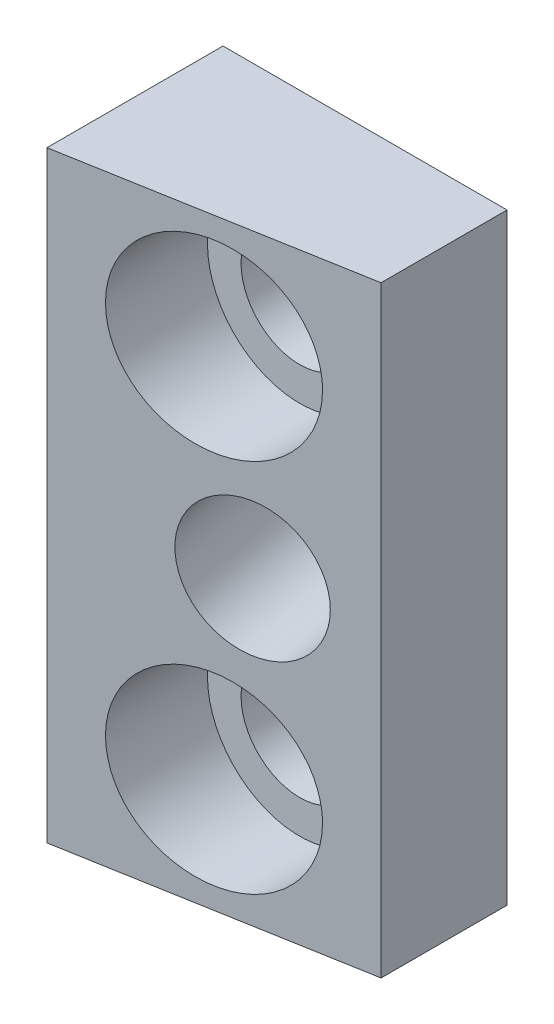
ISO-10303-21;
HEADER;
FILE_DESCRIPTION(('STEP AP214'),'2;1');
FILE_NAME('part.step','',(''),(''),'','','');
FILE_SCHEMA(('AUTOMOTIVE_DESIGN { 1 0 10303 214 1 1 1 1 }'));
ENDSEC;
DATA;
#1=APPLICATION_CONTEXT('core data for automotive mechanical design processes');
#2=APPLICATION_PROTOCOL_DEFINITION('international standard','automotive_design',2000,#1);
#3=PRODUCT_CONTEXT('',#1,'mechanical');
#4=PRODUCT('Part','Part','',(#3));
#5=PRODUCT_RELATED_PRODUCT_CATEGORY('part','',(#4));
#6=PRODUCT_DEFINITION_FORMATION('','',#4);
#7=PRODUCT_DEFINITION_CONTEXT('part definition',#1,'design');
#8=PRODUCT_DEFINITION('design','',#6,#7);
#9=PRODUCT_DEFINITION_SHAPE('','',#8);
#10=(LENGTH_UNIT() NAMED_UNIT(*) SI_UNIT(.MILLI.,.METRE.));
#11=(NAMED_UNIT(*) PLANE_ANGLE_UNIT() SI_UNIT($,.RADIAN.));
#12=(NAMED_UNIT(*) SI_UNIT($,.STERADIAN.) SOLID_ANGLE_UNIT());
#13=UNCERTAINTY_MEASURE_WITH_UNIT(LENGTH_MEASURE(1.E-05),#10,'distance_accuracy_value','');
#14=(GEOMETRIC_REPRESENTATION_CONTEXT(3) GLOBAL_UNCERTAINTY_ASSIGNED_CONTEXT((#13)) GLOBAL_UNIT_ASSIGNED_CONTEXT((#10,
#11,#12)) REPRESENTATION_CONTEXT('',''));
#15=CARTESIAN_POINT('',(0.,0.,0.));
#16=DIRECTION('',(0.,0.,1.));
#17=DIRECTION('',(1.,0.,0.));
#18=AXIS2_PLACEMENT_3D('',#15,#16,#17);
#19=CARTESIAN_POINT('',(-12.7,43.688,15.748));
#20=DIRECTION('',(-0.173648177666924,0.,-0.984807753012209));
#21=DIRECTION('',(-0.984807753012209,0.,0.173648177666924));
#22=AXIS2_PLACEMENT_3D('',#19,#20,#21);
#23=PLANE('',#22);
#24=CARTESIAN_POINT('',(2.93382307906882,16.764,12.9913351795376));
#25=DIRECTION('',(0.173648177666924,0.,0.984807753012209));
#26=DIRECTION('',(0.984807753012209,0.,-0.173648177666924));
#27=AXIS2_PLACEMENT_3D('',#24,#25,#26);
#28=CIRCLE('',#27,6.);
#29=CARTESIAN_POINT('',(8.84266959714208,16.764,11.9494461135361));
#30=VERTEX_POINT('',#29);
#31=EDGE_CURVE('E118',#30,#30,#28,.T.);
#32=ORIENTED_EDGE('',*,*,#31,.F.);
#33=EDGE_LOOP('',(#32));
#34=FACE_BOUND('',#33,.T.);
#35=CARTESIAN_POINT('',(0.,33.528,13.5086473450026));
#36=DIRECTION('',(-0.173648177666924,0.,-0.984807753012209));
#37=DIRECTION('',(0.984807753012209,0.,-0.173648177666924));
#38=AXIS2_PLACEMENT_3D('',#35,#36,#37);
#39=ELLIPSE('',#38,8.37726954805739,8.25);
#40=CARTESIAN_POINT('',(8.25,33.528,12.0539497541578));
#41=VERTEX_POINT('',#40);
#42=EDGE_CURVE('E103',#41,#41,#39,.F.);
#43=ORIENTED_EDGE('',*,*,#42,.F.);
#44=EDGE_LOOP('',(#43));
#45=FACE_BOUND('',#44,.T.);
#46=DIRECTION('',(0.984807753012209,0.,-0.173648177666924));
#47=VECTOR('',#46,1.);
#48=CARTESIAN_POINT('',(-12.7,-10.16,15.748));
#49=LINE('',#48,#47);
#50=CARTESIAN_POINT('',(-12.7,-10.16,15.748));
#51=VERTEX_POINT('',#50);
#52=CARTESIAN_POINT('',(12.7,-10.16,11.2692946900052));
#53=VERTEX_POINT('',#52);
#54=EDGE_CURVE('E87',#51,#53,#49,.T.);
#55=ORIENTED_EDGE('',*,*,#54,.T.);
#56=DIRECTION('',(0.,-1.,0.));
#57=VECTOR('',#56,1.);
#58=CARTESIAN_POINT('',(12.7,43.688,11.2692946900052));
#59=LINE('',#58,#57);
#60=CARTESIAN_POINT('',(12.7,43.688,11.2692946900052));
#61=VERTEX_POINT('',#60);
#62=EDGE_CURVE('E76',#61,#53,#59,.T.);
#63=ORIENTED_EDGE('',*,*,#62,.F.);
#64=DIRECTION('',(0.984807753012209,0.,-0.173648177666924));
#65=VECTOR('',#64,1.);
#66=CARTESIAN_POINT('',(-12.7,43.688,15.748));
#67=LINE('',#66,#65);
#68=CARTESIAN_POINT('',(-12.7,43.688,15.748));
#69=VERTEX_POINT('',#68);
#70=EDGE_CURVE('E34',#69,#61,#67,.T.);
#71=ORIENTED_EDGE('',*,*,#70,.F.);
#72=DIRECTION('',(0.,-1.,0.));
#73=VECTOR('',#72,1.);
#74=CARTESIAN_POINT('',(-12.7,43.688,15.748));
#75=LINE('',#74,#73);
#76=EDGE_CURVE('E95',#69,#51,#75,.T.);
#77=ORIENTED_EDGE('',*,*,#76,.T.);
#78=EDGE_LOOP('',(#55,#63,#71,#77));
#79=FACE_BOUND('',#78,.T.);
#80=CARTESIAN_POINT('',(0.,0.,13.5086473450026));
#81=DIRECTION('',(-0.173648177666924,0.,-0.984807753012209));
#82=DIRECTION('',(0.984807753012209,0.,-0.173648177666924));
#83=AXIS2_PLACEMENT_3D('',#80,#81,#82);
#84=ELLIPSE('',#83,8.37726954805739,8.25);
#85=CARTESIAN_POINT('',(8.25,0.,12.0539497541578));
#86=VERTEX_POINT('',#85);
#87=EDGE_CURVE('E106',#86,#86,#84,.F.);
#88=ORIENTED_EDGE('',*,*,#87,.F.);
#89=EDGE_LOOP('',(#88));
#90=FACE_BOUND('',#89,.T.);
#91=ADVANCED_FACE('F17',(#34,#45,#79,#90),#23,.F.);
#92=CARTESIAN_POINT('',(12.7,43.688,0.));
#93=DIRECTION('',(0.,0.,1.));
#94=DIRECTION('',(1.,0.,0.));
#95=AXIS2_PLACEMENT_3D('',#92,#93,#94);
#96=PLANE('',#95);
#97=CARTESIAN_POINT('',(0.643100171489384,16.764,0.));
#98=DIRECTION('',(0.,0.,1.));
#99=DIRECTION('',(1.,0.,0.));
#100=AXIS2_PLACEMENT_3D('',#97,#98,#99);
#101=ELLIPSE('',#100,6.09255967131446,6.);
#102=CARTESIAN_POINT('',(6.73565984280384,16.764,0.));
#103=VERTEX_POINT('',#102);
#104=EDGE_CURVE('E21',#103,#103,#101,.T.);
#105=ORIENTED_EDGE('',*,*,#104,.T.);
#106=EDGE_LOOP('',(#105));
#107=FACE_BOUND('',#106,.T.);
#108=CARTESIAN_POINT('',(0.,33.528,0.));
#109=DIRECTION('',(0.,0.,-1.));
#110=DIRECTION('',(-1.,0.,0.));
#111=AXIS2_PLACEMENT_3D('',#108,#109,#110);
#112=CIRCLE('',#111,5.25);
#113=CARTESIAN_POINT('',(-5.25,33.528,0.));
#114=VERTEX_POINT('',#113);
#115=EDGE_CURVE('E102',#114,#114,#112,.T.);
#116=ORIENTED_EDGE('',*,*,#115,.F.);
#117=EDGE_LOOP('',(#116));
#118=FACE_BOUND('',#117,.T.);
#119=CARTESIAN_POINT('',(0.,0.,0.));
#120=DIRECTION('',(0.,0.,-1.));
#121=DIRECTION('',(-1.,0.,0.));
#122=AXIS2_PLACEMENT_3D('',#119,#120,#121);
#123=CIRCLE('',#122,5.25);
#124=CARTESIAN_POINT('',(-5.25,0.,0.));
#125=VERTEX_POINT('',#124);
#126=EDGE_CURVE('E80',#125,#125,#123,.T.);
#127=ORIENTED_EDGE('',*,*,#126,.F.);
#128=EDGE_LOOP('',(#127));
#129=FACE_BOUND('',#128,.T.);
#130=DIRECTION('',(-1.,0.,0.));
#131=VECTOR('',#130,1.);
#132=CARTESIAN_POINT('',(12.7,-10.16,0.));
#133=LINE('',#132,#131);
#134=CARTESIAN_POINT('',(12.7,-10.16,0.));
#135=VERTEX_POINT('',#134);
#136=CARTESIAN_POINT('',(-12.7,-10.16,0.));
#137=VERTEX_POINT('',#136);
#138=EDGE_CURVE('E60',#135,#137,#133,.T.);
#139=ORIENTED_EDGE('',*,*,#138,.T.);
#140=DIRECTION('',(0.,-1.,0.));
#141=VECTOR('',#140,1.);
#142=CARTESIAN_POINT('',(-12.7,43.688,0.));
#143=LINE('',#142,#141);
#144=CARTESIAN_POINT('',(-12.7,43.688,0.));
#145=VERTEX_POINT('',#144);
#146=EDGE_CURVE('E26',#145,#137,#143,.T.);
#147=ORIENTED_EDGE('',*,*,#146,.F.);
#148=DIRECTION('',(-1.,0.,0.));
#149=VECTOR('',#148,1.);
#150=CARTESIAN_POINT('',(12.7,43.688,0.));
#151=LINE('',#150,#149);
#152=CARTESIAN_POINT('',(12.7,43.688,0.));
#153=VERTEX_POINT('',#152);
#154=EDGE_CURVE('E72',#153,#145,#151,.T.);
#155=ORIENTED_EDGE('',*,*,#154,.F.);
#156=DIRECTION('',(0.,-1.,0.));
#157=VECTOR('',#156,1.);
#158=CARTESIAN_POINT('',(12.7,43.688,0.));
#159=LINE('',#158,#157);
#160=EDGE_CURVE('E10',#153,#135,#159,.T.);
#161=ORIENTED_EDGE('',*,*,#160,.T.);
#162=EDGE_LOOP('',(#139,#147,#155,#161));
#163=FACE_BOUND('',#162,.T.);
#164=ADVANCED_FACE('F71',(#107,#118,#129,#163),#96,.F.);
#165=CARTESIAN_POINT('',(12.7,43.688,11.2692946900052));
#166=DIRECTION('',(-1.,0.,0.));
#167=DIRECTION('',(0.,0.,1.));
#168=AXIS2_PLACEMENT_3D('',#165,#166,#167);
#169=PLANE('',#168);
#170=DIRECTION('',(0.,0.,-1.));
#171=VECTOR('',#170,1.);
#172=CARTESIAN_POINT('',(12.7,-10.16,11.2692946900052));
#173=LINE('',#172,#171);
#174=EDGE_CURVE('E64',#53,#135,#173,.T.);
#175=ORIENTED_EDGE('',*,*,#174,.T.);
#176=ORIENTED_EDGE('',*,*,#160,.F.);
#177=DIRECTION('',(0.,0.,-1.));
#178=VECTOR('',#177,1.);
#179=CARTESIAN_POINT('',(12.7,43.688,11.2692946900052));
#180=LINE('',#179,#178);
#181=EDGE_CURVE('E89',#61,#153,#180,.T.);
#182=ORIENTED_EDGE('',*,*,#181,.F.);
#183=ORIENTED_EDGE('',*,*,#62,.T.);
#184=EDGE_LOOP('',(#175,#176,#182,#183));
#185=FACE_BOUND('',#184,.T.);
#186=ADVANCED_FACE('F19',(#185),#169,.F.);
#187=CARTESIAN_POINT('',(-12.7,43.688,0.));
#188=DIRECTION('',(1.,0.,0.));
#189=DIRECTION('',(0.,1.,0.));
#190=AXIS2_PLACEMENT_3D('',#187,#188,#189);
#191=PLANE('',#190);
#192=DIRECTION('',(0.,0.,1.));
#193=VECTOR('',#192,1.);
#194=CARTESIAN_POINT('',(-12.7,-10.16,0.));
#195=LINE('',#194,#193);
#196=EDGE_CURVE('E65',#137,#51,#195,.T.);
#197=ORIENTED_EDGE('',*,*,#196,.T.);
#198=ORIENTED_EDGE('',*,*,#76,.F.);
#199=DIRECTION('',(0.,0.,1.));
#200=VECTOR('',#199,1.);
#201=CARTESIAN_POINT('',(-12.7,43.688,0.));
#202=LINE('',#201,#200);
#203=EDGE_CURVE('E39',#145,#69,#202,.T.);
#204=ORIENTED_EDGE('',*,*,#203,.F.);
#205=ORIENTED_EDGE('',*,*,#146,.T.);
#206=EDGE_LOOP('',(#197,#198,#204,#205));
#207=FACE_BOUND('',#206,.T.);
#208=ADVANCED_FACE('F160',(#207),#191,.F.);
#209=CARTESIAN_POINT('',(12.7,43.688,0.));
#210=DIRECTION('',(0.,1.,0.));
#211=DIRECTION('',(-1.,0.,0.));
#212=AXIS2_PLACEMENT_3D('',#209,#210,#211);
#213=PLANE('',#212);
#214=ORIENTED_EDGE('',*,*,#181,.T.);
#215=ORIENTED_EDGE('',*,*,#154,.T.);
#216=ORIENTED_EDGE('',*,*,#203,.T.);
#217=ORIENTED_EDGE('',*,*,#70,.T.);
#218=EDGE_LOOP('',(#214,#215,#216,#217));
#219=FACE_BOUND('',#218,.T.);
#220=ADVANCED_FACE('F158',(#219),#213,.T.);
#221=CARTESIAN_POINT('',(12.7,-10.16,0.));
#222=DIRECTION('',(0.,1.,0.));
#223=DIRECTION('',(-1.,0.,0.));
#224=AXIS2_PLACEMENT_3D('',#221,#222,#223);
#225=PLANE('',#224);
#226=ORIENTED_EDGE('',*,*,#174,.F.);
#227=ORIENTED_EDGE('',*,*,#54,.F.);
#228=ORIENTED_EDGE('',*,*,#196,.F.);
#229=ORIENTED_EDGE('',*,*,#138,.F.);
#230=EDGE_LOOP('',(#226,#227,#228,#229));
#231=FACE_BOUND('',#230,.T.);
#232=ADVANCED_FACE('F61',(#231),#225,.F.);
#233=CARTESIAN_POINT('',(4.953,0.,5.842));
#234=DIRECTION('',(0.,0.,1.));
#235=DIRECTION('',(1.,0.,0.));
#236=AXIS2_PLACEMENT_3D('',#233,#234,#235);
#237=PLANE('',#236);
#238=CARTESIAN_POINT('',(0.,0.,5.842));
#239=DIRECTION('',(0.,0.,1.));
#240=DIRECTION('',(1.,0.,0.));
#241=AXIS2_PLACEMENT_3D('',#238,#239,#240);
#242=CIRCLE('',#241,5.25);
#243=CARTESIAN_POINT('',(5.25,0.,5.842));
#244=VERTEX_POINT('',#243);
#245=EDGE_CURVE('E77',#244,#244,#242,.T.);
#246=ORIENTED_EDGE('',*,*,#245,.F.);
#247=EDGE_LOOP('',(#246));
#248=FACE_BOUND('',#247,.T.);
#249=CARTESIAN_POINT('',(0.,0.,5.842));
#250=DIRECTION('',(0.,0.,1.));
#251=DIRECTION('',(1.,0.,0.));
#252=AXIS2_PLACEMENT_3D('',#249,#250,#251);
#253=CIRCLE('',#252,8.25);
#254=CARTESIAN_POINT('',(8.25,0.,5.842));
#255=VERTEX_POINT('',#254);
#256=EDGE_CURVE('E108',#255,#255,#253,.T.);
#257=ORIENTED_EDGE('',*,*,#256,.T.);
#258=EDGE_LOOP('',(#257));
#259=FACE_BOUND('',#258,.T.);
#260=ADVANCED_FACE('F145',(#248,#259),#237,.T.);
#261=CARTESIAN_POINT('',(4.953,33.528,5.842));
#262=DIRECTION('',(0.,0.,1.));
#263=DIRECTION('',(1.,0.,0.));
#264=AXIS2_PLACEMENT_3D('',#261,#262,#263);
#265=PLANE('',#264);
#266=CARTESIAN_POINT('',(0.,33.528,5.842));
#267=DIRECTION('',(0.,0.,1.));
#268=DIRECTION('',(1.,0.,0.));
#269=AXIS2_PLACEMENT_3D('',#266,#267,#268);
#270=CIRCLE('',#269,5.25);
#271=CARTESIAN_POINT('',(5.25,33.528,5.842));
#272=VERTEX_POINT('',#271);
#273=EDGE_CURVE('E99',#272,#272,#270,.T.);
#274=ORIENTED_EDGE('',*,*,#273,.F.);
#275=EDGE_LOOP('',(#274));
#276=FACE_BOUND('',#275,.T.);
#277=CARTESIAN_POINT('',(0.,33.528,5.842));
#278=DIRECTION('',(0.,0.,1.));
#279=DIRECTION('',(1.,0.,0.));
#280=AXIS2_PLACEMENT_3D('',#277,#278,#279);
#281=CIRCLE('',#280,8.25);
#282=CARTESIAN_POINT('',(8.25,33.528,5.842));
#283=VERTEX_POINT('',#282);
#284=EDGE_CURVE('E105',#283,#283,#281,.T.);
#285=ORIENTED_EDGE('',*,*,#284,.T.);
#286=EDGE_LOOP('',(#285));
#287=FACE_BOUND('',#286,.T.);
#288=ADVANCED_FACE('F133',(#276,#287),#265,.T.);
#289=CARTESIAN_POINT('',(0.,0.,10.));
#290=DIRECTION('',(0.,0.,-1.));
#291=DIRECTION('',(-1.,0.,0.));
#292=AXIS2_PLACEMENT_3D('',#289,#290,#291);
#293=CYLINDRICAL_SURFACE('',#292,5.25);
#294=ORIENTED_EDGE('',*,*,#245,.T.);
#295=EDGE_LOOP('',(#294));
#296=FACE_BOUND('',#295,.T.);
#297=ORIENTED_EDGE('',*,*,#126,.T.);
#298=EDGE_LOOP('',(#297));
#299=FACE_BOUND('',#298,.T.);
#300=ADVANCED_FACE('F131',(#296,#299),#293,.F.);
#301=CARTESIAN_POINT('',(0.,33.528,10.));
#302=DIRECTION('',(0.,0.,-1.));
#303=DIRECTION('',(-1.,0.,0.));
#304=AXIS2_PLACEMENT_3D('',#301,#302,#303);
#305=CYLINDRICAL_SURFACE('',#304,5.25);
#306=ORIENTED_EDGE('',*,*,#273,.T.);
#307=EDGE_LOOP('',(#306));
#308=FACE_BOUND('',#307,.T.);
#309=ORIENTED_EDGE('',*,*,#115,.T.);
#310=EDGE_LOOP('',(#309));
#311=FACE_BOUND('',#310,.T.);
#312=ADVANCED_FACE('F123',(#308,#311),#305,.F.);
#313=CARTESIAN_POINT('',(0.,33.528,15.842));
#314=DIRECTION('',(0.,0.,-1.));
#315=DIRECTION('',(-1.,0.,0.));
#316=AXIS2_PLACEMENT_3D('',#313,#314,#315);
#317=CYLINDRICAL_SURFACE('',#316,8.25);
#318=ORIENTED_EDGE('',*,*,#284,.F.);
#319=EDGE_LOOP('',(#318));
#320=FACE_BOUND('',#319,.T.);
#321=ORIENTED_EDGE('',*,*,#42,.T.);
#322=EDGE_LOOP('',(#321));
#323=FACE_BOUND('',#322,.T.);
#324=ADVANCED_FACE('F142',(#320,#323),#317,.F.);
#325=CARTESIAN_POINT('',(0.,0.,15.842));
#326=DIRECTION('',(0.,0.,-1.));
#327=DIRECTION('',(-1.,0.,0.));
#328=AXIS2_PLACEMENT_3D('',#325,#326,#327);
#329=CYLINDRICAL_SURFACE('',#328,8.25);
#330=ORIENTED_EDGE('',*,*,#256,.F.);
#331=EDGE_LOOP('',(#330));
#332=FACE_BOUND('',#331,.T.);
#333=ORIENTED_EDGE('',*,*,#87,.T.);
#334=EDGE_LOOP('',(#333));
#335=FACE_BOUND('',#334,.T.);
#336=ADVANCED_FACE('F206',(#332,#335),#329,.F.);
#337=CARTESIAN_POINT('',(0.240756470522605,16.764,-2.28180451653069));
#338=DIRECTION('',(0.173648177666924,0.,0.984807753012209));
#339=DIRECTION('',(0.984807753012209,0.,-0.173648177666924));
#340=AXIS2_PLACEMENT_3D('',#337,#338,#339);
#341=CYLINDRICAL_SURFACE('',#340,6.);
#342=ORIENTED_EDGE('',*,*,#31,.T.);
#343=EDGE_LOOP('',(#342));
#344=FACE_BOUND('',#343,.T.);
#345=ORIENTED_EDGE('',*,*,#104,.F.);
#346=EDGE_LOOP('',(#345));
#347=FACE_BOUND('',#346,.T.);
#348=ADVANCED_FACE('F211',(#344,#347),#341,.F.);
#349=CLOSED_SHELL('',(#91,#164,#186,#208,#220,#232,#260,#288,#300,#312,#324,#336,#348));
#350=MANIFOLD_SOLID_BREP('B1',#349);
#351=ADVANCED_BREP_SHAPE_REPRESENTATION('',(#18,#350),#14);
#352=SHAPE_DEFINITION_REPRESENTATION(#9,#351);
ENDSEC;
END-ISO-10303-21;
